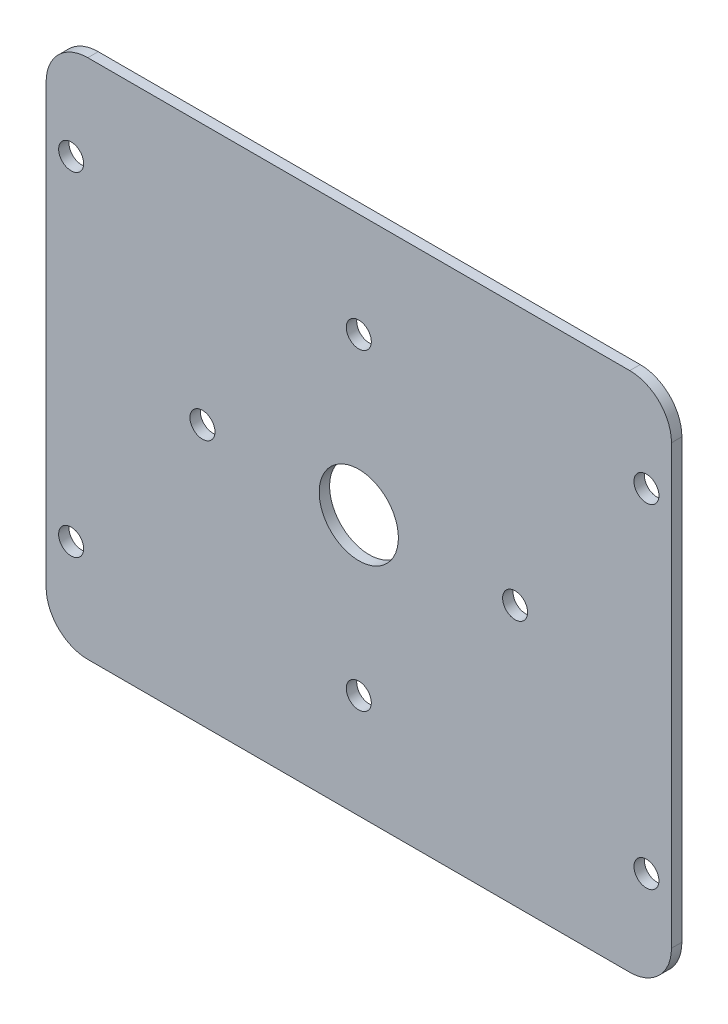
ISO-10303-21;
HEADER;
FILE_DESCRIPTION(('STEP AP214'),'2;1');
FILE_NAME('part.step','',(''),(''),'','','');
FILE_SCHEMA(('AUTOMOTIVE_DESIGN { 1 0 10303 214 1 1 1 1 }'));
ENDSEC;
DATA;
#1=APPLICATION_CONTEXT('core data for automotive mechanical design processes');
#2=APPLICATION_PROTOCOL_DEFINITION('international standard','automotive_design',2000,#1);
#3=PRODUCT_CONTEXT('',#1,'mechanical');
#4=PRODUCT('Part','Part','',(#3));
#5=PRODUCT_RELATED_PRODUCT_CATEGORY('part','',(#4));
#6=PRODUCT_DEFINITION_FORMATION('','',#4);
#7=PRODUCT_DEFINITION_CONTEXT('part definition',#1,'design');
#8=PRODUCT_DEFINITION('design','',#6,#7);
#9=PRODUCT_DEFINITION_SHAPE('','',#8);
#10=(LENGTH_UNIT() NAMED_UNIT(*) SI_UNIT(.MILLI.,.METRE.));
#11=(NAMED_UNIT(*) PLANE_ANGLE_UNIT() SI_UNIT($,.RADIAN.));
#12=(NAMED_UNIT(*) SI_UNIT($,.STERADIAN.) SOLID_ANGLE_UNIT());
#13=UNCERTAINTY_MEASURE_WITH_UNIT(LENGTH_MEASURE(1.E-05),#10,'distance_accuracy_value','');
#14=(GEOMETRIC_REPRESENTATION_CONTEXT(3) GLOBAL_UNCERTAINTY_ASSIGNED_CONTEXT((#13)) GLOBAL_UNIT_ASSIGNED_CONTEXT((#10,
#11,#12)) REPRESENTATION_CONTEXT('',''));
#15=CARTESIAN_POINT('',(0.,0.,0.));
#16=DIRECTION('',(0.,0.,1.));
#17=DIRECTION('',(1.,0.,0.));
#18=AXIS2_PLACEMENT_3D('',#15,#16,#17);
#19=CARTESIAN_POINT('',(0.,0.,5.));
#20=DIRECTION('',(1.,0.,0.));
#21=DIRECTION('',(0.,0.,-1.));
#22=AXIS2_PLACEMENT_3D('',#19,#20,#21);
#23=PLANE('',#22);
#24=DIRECTION('',(0.,-1.,0.));
#25=VECTOR('',#24,1.);
#26=CARTESIAN_POINT('',(0.,0.,0.));
#27=LINE('',#26,#25);
#28=CARTESIAN_POINT('',(0.,230.,0.));
#29=VERTEX_POINT('',#28);
#30=CARTESIAN_POINT('',(0.,20.,0.));
#31=VERTEX_POINT('',#30);
#32=EDGE_CURVE('E127',#29,#31,#27,.T.);
#33=ORIENTED_EDGE('',*,*,#32,.T.);
#34=DIRECTION('',(0.,0.,-1.));
#35=VECTOR('',#34,1.);
#36=CARTESIAN_POINT('',(0.,20.,5.));
#37=LINE('',#36,#35);
#38=CARTESIAN_POINT('',(0.,20.,5.));
#39=VERTEX_POINT('',#38);
#40=EDGE_CURVE('E105',#31,#39,#37,.F.);
#41=ORIENTED_EDGE('',*,*,#40,.T.);
#42=DIRECTION('',(0.,-1.,0.));
#43=VECTOR('',#42,1.);
#44=CARTESIAN_POINT('',(0.,0.,5.));
#45=LINE('',#44,#43);
#46=CARTESIAN_POINT('',(0.,230.,5.));
#47=VERTEX_POINT('',#46);
#48=EDGE_CURVE('E137',#47,#39,#45,.T.);
#49=ORIENTED_EDGE('',*,*,#48,.F.);
#50=DIRECTION('',(0.,0.,-1.));
#51=VECTOR('',#50,1.);
#52=CARTESIAN_POINT('',(0.,230.,5.));
#53=LINE('',#52,#51);
#54=EDGE_CURVE('E110',#47,#29,#53,.T.);
#55=ORIENTED_EDGE('',*,*,#54,.T.);
#56=EDGE_LOOP('',(#33,#41,#49,#55));
#57=FACE_BOUND('',#56,.T.);
#58=ADVANCED_FACE('F35',(#57),#23,.F.);
#59=CARTESIAN_POINT('',(0.,0.,5.));
#60=DIRECTION('',(0.,1.,0.));
#61=DIRECTION('',(0.,0.,1.));
#62=AXIS2_PLACEMENT_3D('',#59,#60,#61);
#63=PLANE('',#62);
#64=DIRECTION('',(1.,0.,0.));
#65=VECTOR('',#64,1.);
#66=CARTESIAN_POINT('',(0.,0.,5.));
#67=LINE('',#66,#65);
#68=CARTESIAN_POINT('',(20.,0.,5.));
#69=VERTEX_POINT('',#68);
#70=CARTESIAN_POINT('',(280.,0.,5.));
#71=VERTEX_POINT('',#70);
#72=EDGE_CURVE('E120',#69,#71,#67,.T.);
#73=ORIENTED_EDGE('',*,*,#72,.F.);
#74=DIRECTION('',(0.,0.,-1.));
#75=VECTOR('',#74,1.);
#76=CARTESIAN_POINT('',(20.,0.,5.));
#77=LINE('',#76,#75);
#78=CARTESIAN_POINT('',(20.,0.,0.));
#79=VERTEX_POINT('',#78);
#80=EDGE_CURVE('E104',#69,#79,#77,.T.);
#81=ORIENTED_EDGE('',*,*,#80,.T.);
#82=DIRECTION('',(1.,0.,0.));
#83=VECTOR('',#82,1.);
#84=CARTESIAN_POINT('',(0.,0.,0.));
#85=LINE('',#84,#83);
#86=CARTESIAN_POINT('',(280.,0.,0.));
#87=VERTEX_POINT('',#86);
#88=EDGE_CURVE('E117',#79,#87,#85,.T.);
#89=ORIENTED_EDGE('',*,*,#88,.T.);
#90=DIRECTION('',(0.,0.,-1.));
#91=VECTOR('',#90,1.);
#92=CARTESIAN_POINT('',(280.,0.,5.));
#93=LINE('',#92,#91);
#94=EDGE_CURVE('E122',#87,#71,#93,.F.);
#95=ORIENTED_EDGE('',*,*,#94,.T.);
#96=EDGE_LOOP('',(#73,#81,#89,#95));
#97=FACE_BOUND('',#96,.T.);
#98=ADVANCED_FACE('F116',(#97),#63,.F.);
#99=CARTESIAN_POINT('',(300.,0.,5.));
#100=DIRECTION('',(-1.,0.,0.));
#101=DIRECTION('',(0.,0.,1.));
#102=AXIS2_PLACEMENT_3D('',#99,#100,#101);
#103=PLANE('',#102);
#104=DIRECTION('',(0.,1.,0.));
#105=VECTOR('',#104,1.);
#106=CARTESIAN_POINT('',(300.,0.,5.));
#107=LINE('',#106,#105);
#108=CARTESIAN_POINT('',(300.,20.,5.));
#109=VERTEX_POINT('',#108);
#110=CARTESIAN_POINT('',(300.,230.,5.));
#111=VERTEX_POINT('',#110);
#112=EDGE_CURVE('E141',#109,#111,#107,.T.);
#113=ORIENTED_EDGE('',*,*,#112,.F.);
#114=DIRECTION('',(0.,0.,-1.));
#115=VECTOR('',#114,1.);
#116=CARTESIAN_POINT('',(300.,20.,5.));
#117=LINE('',#116,#115);
#118=CARTESIAN_POINT('',(300.,20.,0.));
#119=VERTEX_POINT('',#118);
#120=EDGE_CURVE('E162',#109,#119,#117,.T.);
#121=ORIENTED_EDGE('',*,*,#120,.T.);
#122=DIRECTION('',(0.,1.,0.));
#123=VECTOR('',#122,1.);
#124=CARTESIAN_POINT('',(300.,0.,0.));
#125=LINE('',#124,#123);
#126=CARTESIAN_POINT('',(300.,230.,0.));
#127=VERTEX_POINT('',#126);
#128=EDGE_CURVE('E126',#119,#127,#125,.T.);
#129=ORIENTED_EDGE('',*,*,#128,.T.);
#130=DIRECTION('',(0.,0.,-1.));
#131=VECTOR('',#130,1.);
#132=CARTESIAN_POINT('',(300.,230.,5.));
#133=LINE('',#132,#131);
#134=EDGE_CURVE('E160',#127,#111,#133,.F.);
#135=ORIENTED_EDGE('',*,*,#134,.T.);
#136=EDGE_LOOP('',(#113,#121,#129,#135));
#137=FACE_BOUND('',#136,.T.);
#138=ADVANCED_FACE('F167',(#137),#103,.F.);
#139=CARTESIAN_POINT('',(0.,250.,5.));
#140=DIRECTION('',(0.,-1.,0.));
#141=DIRECTION('',(0.,0.,-1.));
#142=AXIS2_PLACEMENT_3D('',#139,#140,#141);
#143=PLANE('',#142);
#144=DIRECTION('',(-1.,0.,0.));
#145=VECTOR('',#144,1.);
#146=CARTESIAN_POINT('',(0.,250.,5.));
#147=LINE('',#146,#145);
#148=CARTESIAN_POINT('',(280.,250.,5.));
#149=VERTEX_POINT('',#148);
#150=CARTESIAN_POINT('',(20.,250.,5.));
#151=VERTEX_POINT('',#150);
#152=EDGE_CURVE('E143',#149,#151,#147,.T.);
#153=ORIENTED_EDGE('',*,*,#152,.F.);
#154=DIRECTION('',(0.,0.,-1.));
#155=VECTOR('',#154,1.);
#156=CARTESIAN_POINT('',(280.,250.,5.));
#157=LINE('',#156,#155);
#158=CARTESIAN_POINT('',(280.,250.,0.));
#159=VERTEX_POINT('',#158);
#160=EDGE_CURVE('E11',#149,#159,#157,.T.);
#161=ORIENTED_EDGE('',*,*,#160,.T.);
#162=DIRECTION('',(-1.,0.,0.));
#163=VECTOR('',#162,1.);
#164=CARTESIAN_POINT('',(0.,250.,0.));
#165=LINE('',#164,#163);
#166=CARTESIAN_POINT('',(20.,250.,0.));
#167=VERTEX_POINT('',#166);
#168=EDGE_CURVE('E130',#159,#167,#165,.T.);
#169=ORIENTED_EDGE('',*,*,#168,.T.);
#170=DIRECTION('',(0.,0.,-1.));
#171=VECTOR('',#170,1.);
#172=CARTESIAN_POINT('',(20.,250.,5.));
#173=LINE('',#172,#171);
#174=EDGE_CURVE('E42',#167,#151,#173,.F.);
#175=ORIENTED_EDGE('',*,*,#174,.T.);
#176=EDGE_LOOP('',(#153,#161,#169,#175));
#177=FACE_BOUND('',#176,.T.);
#178=ADVANCED_FACE('F175',(#177),#143,.F.);
#179=CARTESIAN_POINT('',(0.,250.,5.));
#180=DIRECTION('',(0.,0.,-1.));
#181=DIRECTION('',(-1.,0.,0.));
#182=AXIS2_PLACEMENT_3D('',#179,#180,#181);
#183=PLANE('',#182);
#184=CARTESIAN_POINT('',(149.999999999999,200.,5.));
#185=DIRECTION('',(0.,0.,-1.));
#186=DIRECTION('',(-1.,0.,0.));
#187=AXIS2_PLACEMENT_3D('',#184,#185,#186);
#188=CIRCLE('',#187,6.00000000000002);
#189=CARTESIAN_POINT('',(143.999999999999,200.,5.));
#190=VERTEX_POINT('',#189);
#191=EDGE_CURVE('E267',#190,#190,#188,.T.);
#192=ORIENTED_EDGE('',*,*,#191,.T.);
#193=EDGE_LOOP('',(#192));
#194=FACE_BOUND('',#193,.T.);
#195=CARTESIAN_POINT('',(75.,124.999999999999,5.));
#196=DIRECTION('',(0.,0.,-1.));
#197=DIRECTION('',(-1.,0.,0.));
#198=AXIS2_PLACEMENT_3D('',#195,#196,#197);
#199=CIRCLE('',#198,6.);
#200=CARTESIAN_POINT('',(69.,124.999999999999,5.));
#201=VERTEX_POINT('',#200);
#202=EDGE_CURVE('E261',#201,#201,#199,.T.);
#203=ORIENTED_EDGE('',*,*,#202,.T.);
#204=EDGE_LOOP('',(#203));
#205=FACE_BOUND('',#204,.T.);
#206=CARTESIAN_POINT('',(150.,50.,5.));
#207=DIRECTION('',(0.,0.,-1.));
#208=DIRECTION('',(-1.,0.,0.));
#209=AXIS2_PLACEMENT_3D('',#206,#207,#208);
#210=CIRCLE('',#209,6.00000000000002);
#211=CARTESIAN_POINT('',(144.,50.,5.));
#212=VERTEX_POINT('',#211);
#213=EDGE_CURVE('E255',#212,#212,#210,.T.);
#214=ORIENTED_EDGE('',*,*,#213,.T.);
#215=EDGE_LOOP('',(#214));
#216=FACE_BOUND('',#215,.T.);
#217=CARTESIAN_POINT('',(225.,125.,5.));
#218=DIRECTION('',(0.,0.,-1.));
#219=DIRECTION('',(-1.,0.,0.));
#220=AXIS2_PLACEMENT_3D('',#217,#218,#219);
#221=CIRCLE('',#220,6.00000000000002);
#222=CARTESIAN_POINT('',(219.,125.,5.));
#223=VERTEX_POINT('',#222);
#224=EDGE_CURVE('E249',#223,#223,#221,.T.);
#225=ORIENTED_EDGE('',*,*,#224,.T.);
#226=EDGE_LOOP('',(#225));
#227=FACE_BOUND('',#226,.T.);
#228=CARTESIAN_POINT('',(288.,205.,5.));
#229=DIRECTION('',(0.,0.,1.));
#230=DIRECTION('',(-1.,0.,0.));
#231=AXIS2_PLACEMENT_3D('',#228,#229,#230);
#232=CIRCLE('',#231,5.99999999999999);
#233=CARTESIAN_POINT('',(282.,205.,5.));
#234=VERTEX_POINT('',#233);
#235=EDGE_CURVE('E245',#234,#234,#232,.T.);
#236=ORIENTED_EDGE('',*,*,#235,.F.);
#237=EDGE_LOOP('',(#236));
#238=FACE_BOUND('',#237,.T.);
#239=CARTESIAN_POINT('',(288.,45.,5.));
#240=DIRECTION('',(0.,0.,1.));
#241=DIRECTION('',(1.,0.,0.));
#242=AXIS2_PLACEMENT_3D('',#239,#240,#241);
#243=CIRCLE('',#242,5.99999999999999);
#244=CARTESIAN_POINT('',(294.,45.,5.));
#245=VERTEX_POINT('',#244);
#246=EDGE_CURVE('E238',#245,#245,#243,.T.);
#247=ORIENTED_EDGE('',*,*,#246,.F.);
#248=EDGE_LOOP('',(#247));
#249=FACE_BOUND('',#248,.T.);
#250=CARTESIAN_POINT('',(12.,45.,5.));
#251=DIRECTION('',(0.,0.,1.));
#252=DIRECTION('',(-1.,0.,0.));
#253=AXIS2_PLACEMENT_3D('',#250,#251,#252);
#254=CIRCLE('',#253,6.00000000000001);
#255=CARTESIAN_POINT('',(5.99999999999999,45.,5.));
#256=VERTEX_POINT('',#255);
#257=EDGE_CURVE('E232',#256,#256,#254,.T.);
#258=ORIENTED_EDGE('',*,*,#257,.F.);
#259=EDGE_LOOP('',(#258));
#260=FACE_BOUND('',#259,.T.);
#261=CARTESIAN_POINT('',(12.,205.,5.));
#262=DIRECTION('',(0.,0.,1.));
#263=DIRECTION('',(1.,0.,0.));
#264=AXIS2_PLACEMENT_3D('',#261,#262,#263);
#265=CIRCLE('',#264,6.00000000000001);
#266=CARTESIAN_POINT('',(18.,205.,5.));
#267=VERTEX_POINT('',#266);
#268=EDGE_CURVE('E224',#267,#267,#265,.T.);
#269=ORIENTED_EDGE('',*,*,#268,.F.);
#270=EDGE_LOOP('',(#269));
#271=FACE_BOUND('',#270,.T.);
#272=CARTESIAN_POINT('',(150.,125.,5.));
#273=DIRECTION('',(0.,0.,1.));
#274=DIRECTION('',(1.,0.,0.));
#275=AXIS2_PLACEMENT_3D('',#272,#273,#274);
#276=CIRCLE('',#275,19.);
#277=CARTESIAN_POINT('',(169.,125.,5.));
#278=VERTEX_POINT('',#277);
#279=EDGE_CURVE('E219',#278,#278,#276,.T.);
#280=ORIENTED_EDGE('',*,*,#279,.F.);
#281=EDGE_LOOP('',(#280));
#282=FACE_BOUND('',#281,.T.);
#283=ORIENTED_EDGE('',*,*,#48,.T.);
#284=CARTESIAN_POINT('',(20.,20.,5.));
#285=DIRECTION('',(0.,0.,-1.));
#286=DIRECTION('',(-1.,0.,0.));
#287=AXIS2_PLACEMENT_3D('',#284,#285,#286);
#288=CIRCLE('',#287,20.);
#289=EDGE_CURVE('E158',#39,#69,#288,.F.);
#290=ORIENTED_EDGE('',*,*,#289,.T.);
#291=ORIENTED_EDGE('',*,*,#72,.T.);
#292=CARTESIAN_POINT('',(280.,20.,5.));
#293=DIRECTION('',(0.,0.,-1.));
#294=DIRECTION('',(-1.,0.,0.));
#295=AXIS2_PLACEMENT_3D('',#292,#293,#294);
#296=CIRCLE('',#295,20.);
#297=EDGE_CURVE('E156',#71,#109,#296,.F.);
#298=ORIENTED_EDGE('',*,*,#297,.T.);
#299=ORIENTED_EDGE('',*,*,#112,.T.);
#300=CARTESIAN_POINT('',(280.,230.,5.));
#301=DIRECTION('',(0.,0.,-1.));
#302=DIRECTION('',(-1.,0.,0.));
#303=AXIS2_PLACEMENT_3D('',#300,#301,#302);
#304=CIRCLE('',#303,20.);
#305=EDGE_CURVE('E55',#111,#149,#304,.F.);
#306=ORIENTED_EDGE('',*,*,#305,.T.);
#307=ORIENTED_EDGE('',*,*,#152,.T.);
#308=CARTESIAN_POINT('',(20.,230.,5.));
#309=DIRECTION('',(0.,0.,-1.));
#310=DIRECTION('',(-1.,0.,0.));
#311=AXIS2_PLACEMENT_3D('',#308,#309,#310);
#312=CIRCLE('',#311,20.);
#313=EDGE_CURVE('E153',#151,#47,#312,.F.);
#314=ORIENTED_EDGE('',*,*,#313,.T.);
#315=EDGE_LOOP('',(#283,#290,#291,#298,#299,#306,#307,#314));
#316=FACE_BOUND('',#315,.T.);
#317=ADVANCED_FACE('F177',(#194,#205,#216,#227,#238,#249,#260,#271,#282,#316),#183,.F.);
#318=CARTESIAN_POINT('',(0.,250.,0.));
#319=DIRECTION('',(0.,0.,-1.));
#320=DIRECTION('',(-1.,0.,0.));
#321=AXIS2_PLACEMENT_3D('',#318,#319,#320);
#322=PLANE('',#321);
#323=CARTESIAN_POINT('',(149.999999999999,200.,0.));
#324=DIRECTION('',(0.,0.,-1.));
#325=DIRECTION('',(-1.,0.,0.));
#326=AXIS2_PLACEMENT_3D('',#323,#324,#325);
#327=CIRCLE('',#326,6.00000000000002);
#328=CARTESIAN_POINT('',(143.999999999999,200.,0.));
#329=VERTEX_POINT('',#328);
#330=EDGE_CURVE('E270',#329,#329,#327,.T.);
#331=ORIENTED_EDGE('',*,*,#330,.F.);
#332=EDGE_LOOP('',(#331));
#333=FACE_BOUND('',#332,.T.);
#334=CARTESIAN_POINT('',(75.,124.999999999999,0.));
#335=DIRECTION('',(0.,0.,-1.));
#336=DIRECTION('',(-1.,0.,0.));
#337=AXIS2_PLACEMENT_3D('',#334,#335,#336);
#338=CIRCLE('',#337,6.);
#339=CARTESIAN_POINT('',(69.,124.999999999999,0.));
#340=VERTEX_POINT('',#339);
#341=EDGE_CURVE('E264',#340,#340,#338,.T.);
#342=ORIENTED_EDGE('',*,*,#341,.F.);
#343=EDGE_LOOP('',(#342));
#344=FACE_BOUND('',#343,.T.);
#345=CARTESIAN_POINT('',(150.,50.,0.));
#346=DIRECTION('',(0.,0.,-1.));
#347=DIRECTION('',(-1.,0.,0.));
#348=AXIS2_PLACEMENT_3D('',#345,#346,#347);
#349=CIRCLE('',#348,6.00000000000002);
#350=CARTESIAN_POINT('',(144.,50.,0.));
#351=VERTEX_POINT('',#350);
#352=EDGE_CURVE('E258',#351,#351,#349,.T.);
#353=ORIENTED_EDGE('',*,*,#352,.F.);
#354=EDGE_LOOP('',(#353));
#355=FACE_BOUND('',#354,.T.);
#356=CARTESIAN_POINT('',(225.,125.,0.));
#357=DIRECTION('',(0.,0.,-1.));
#358=DIRECTION('',(-1.,0.,0.));
#359=AXIS2_PLACEMENT_3D('',#356,#357,#358);
#360=CIRCLE('',#359,6.00000000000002);
#361=CARTESIAN_POINT('',(219.,125.,0.));
#362=VERTEX_POINT('',#361);
#363=EDGE_CURVE('E252',#362,#362,#360,.T.);
#364=ORIENTED_EDGE('',*,*,#363,.F.);
#365=EDGE_LOOP('',(#364));
#366=FACE_BOUND('',#365,.T.);
#367=CARTESIAN_POINT('',(288.,205.,0.));
#368=DIRECTION('',(0.,0.,1.));
#369=DIRECTION('',(-1.,0.,0.));
#370=AXIS2_PLACEMENT_3D('',#367,#368,#369);
#371=CIRCLE('',#370,5.99999999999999);
#372=CARTESIAN_POINT('',(282.,205.,0.));
#373=VERTEX_POINT('',#372);
#374=EDGE_CURVE('E242',#373,#373,#371,.T.);
#375=ORIENTED_EDGE('',*,*,#374,.T.);
#376=EDGE_LOOP('',(#375));
#377=FACE_BOUND('',#376,.T.);
#378=CARTESIAN_POINT('',(288.,45.,0.));
#379=DIRECTION('',(0.,0.,1.));
#380=DIRECTION('',(1.,0.,0.));
#381=AXIS2_PLACEMENT_3D('',#378,#379,#380);
#382=CIRCLE('',#381,5.99999999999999);
#383=CARTESIAN_POINT('',(294.,45.,0.));
#384=VERTEX_POINT('',#383);
#385=EDGE_CURVE('E235',#384,#384,#382,.T.);
#386=ORIENTED_EDGE('',*,*,#385,.T.);
#387=EDGE_LOOP('',(#386));
#388=FACE_BOUND('',#387,.T.);
#389=CARTESIAN_POINT('',(12.,45.,0.));
#390=DIRECTION('',(0.,0.,1.));
#391=DIRECTION('',(-1.,0.,0.));
#392=AXIS2_PLACEMENT_3D('',#389,#390,#391);
#393=CIRCLE('',#392,6.00000000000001);
#394=CARTESIAN_POINT('',(5.99999999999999,45.,0.));
#395=VERTEX_POINT('',#394);
#396=EDGE_CURVE('E229',#395,#395,#393,.T.);
#397=ORIENTED_EDGE('',*,*,#396,.T.);
#398=EDGE_LOOP('',(#397));
#399=FACE_BOUND('',#398,.T.);
#400=CARTESIAN_POINT('',(12.,205.,0.));
#401=DIRECTION('',(0.,0.,1.));
#402=DIRECTION('',(1.,0.,0.));
#403=AXIS2_PLACEMENT_3D('',#400,#401,#402);
#404=CIRCLE('',#403,6.00000000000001);
#405=CARTESIAN_POINT('',(18.,205.,0.));
#406=VERTEX_POINT('',#405);
#407=EDGE_CURVE('E221',#406,#406,#404,.T.);
#408=ORIENTED_EDGE('',*,*,#407,.T.);
#409=EDGE_LOOP('',(#408));
#410=FACE_BOUND('',#409,.T.);
#411=CARTESIAN_POINT('',(150.,125.,0.));
#412=DIRECTION('',(0.,0.,1.));
#413=DIRECTION('',(1.,0.,0.));
#414=AXIS2_PLACEMENT_3D('',#411,#412,#413);
#415=CIRCLE('',#414,19.);
#416=CARTESIAN_POINT('',(169.,125.,0.));
#417=VERTEX_POINT('',#416);
#418=EDGE_CURVE('E132',#417,#417,#415,.T.);
#419=ORIENTED_EDGE('',*,*,#418,.T.);
#420=EDGE_LOOP('',(#419));
#421=FACE_BOUND('',#420,.T.);
#422=ORIENTED_EDGE('',*,*,#88,.F.);
#423=CARTESIAN_POINT('',(20.,20.,0.));
#424=DIRECTION('',(0.,0.,-1.));
#425=DIRECTION('',(-1.,0.,0.));
#426=AXIS2_PLACEMENT_3D('',#423,#424,#425);
#427=CIRCLE('',#426,20.);
#428=EDGE_CURVE('E100',#79,#31,#427,.T.);
#429=ORIENTED_EDGE('',*,*,#428,.T.);
#430=ORIENTED_EDGE('',*,*,#32,.F.);
#431=CARTESIAN_POINT('',(20.,230.,0.));
#432=DIRECTION('',(0.,0.,-1.));
#433=DIRECTION('',(-1.,0.,0.));
#434=AXIS2_PLACEMENT_3D('',#431,#432,#433);
#435=CIRCLE('',#434,20.);
#436=EDGE_CURVE('E121',#29,#167,#435,.T.);
#437=ORIENTED_EDGE('',*,*,#436,.T.);
#438=ORIENTED_EDGE('',*,*,#168,.F.);
#439=CARTESIAN_POINT('',(280.,230.,0.));
#440=DIRECTION('',(0.,0.,-1.));
#441=DIRECTION('',(-1.,0.,0.));
#442=AXIS2_PLACEMENT_3D('',#439,#440,#441);
#443=CIRCLE('',#442,20.);
#444=EDGE_CURVE('E147',#159,#127,#443,.T.);
#445=ORIENTED_EDGE('',*,*,#444,.T.);
#446=ORIENTED_EDGE('',*,*,#128,.F.);
#447=CARTESIAN_POINT('',(280.,20.,0.));
#448=DIRECTION('',(0.,0.,-1.));
#449=DIRECTION('',(-1.,0.,0.));
#450=AXIS2_PLACEMENT_3D('',#447,#448,#449);
#451=CIRCLE('',#450,20.);
#452=EDGE_CURVE('E111',#119,#87,#451,.T.);
#453=ORIENTED_EDGE('',*,*,#452,.T.);
#454=EDGE_LOOP('',(#422,#429,#430,#437,#438,#445,#446,#453));
#455=FACE_BOUND('',#454,.T.);
#456=ADVANCED_FACE('F124',(#333,#344,#355,#366,#377,#388,#399,#410,#421,#455),#322,.T.);
#457=CARTESIAN_POINT('',(150.,125.,0.));
#458=DIRECTION('',(0.,0.,1.));
#459=DIRECTION('',(1.,0.,0.));
#460=AXIS2_PLACEMENT_3D('',#457,#458,#459);
#461=CYLINDRICAL_SURFACE('',#460,19.);
#462=ORIENTED_EDGE('',*,*,#418,.F.);
#463=EDGE_LOOP('',(#462));
#464=FACE_BOUND('',#463,.T.);
#465=ORIENTED_EDGE('',*,*,#279,.T.);
#466=EDGE_LOOP('',(#465));
#467=FACE_BOUND('',#466,.T.);
#468=ADVANCED_FACE('F191',(#464,#467),#461,.F.);
#469=CARTESIAN_POINT('',(20.,20.,5.));
#470=DIRECTION('',(0.,0.,-1.));
#471=DIRECTION('',(-1.,0.,0.));
#472=AXIS2_PLACEMENT_3D('',#469,#470,#471);
#473=CYLINDRICAL_SURFACE('',#472,20.);
#474=ORIENTED_EDGE('',*,*,#289,.F.);
#475=ORIENTED_EDGE('',*,*,#40,.F.);
#476=ORIENTED_EDGE('',*,*,#428,.F.);
#477=ORIENTED_EDGE('',*,*,#80,.F.);
#478=EDGE_LOOP('',(#474,#475,#476,#477));
#479=FACE_BOUND('',#478,.T.);
#480=ADVANCED_FACE('F103',(#479),#473,.T.);
#481=CARTESIAN_POINT('',(280.,20.,5.));
#482=DIRECTION('',(0.,0.,-1.));
#483=DIRECTION('',(-1.,0.,0.));
#484=AXIS2_PLACEMENT_3D('',#481,#482,#483);
#485=CYLINDRICAL_SURFACE('',#484,20.);
#486=ORIENTED_EDGE('',*,*,#297,.F.);
#487=ORIENTED_EDGE('',*,*,#94,.F.);
#488=ORIENTED_EDGE('',*,*,#452,.F.);
#489=ORIENTED_EDGE('',*,*,#120,.F.);
#490=EDGE_LOOP('',(#486,#487,#488,#489));
#491=FACE_BOUND('',#490,.T.);
#492=ADVANCED_FACE('F183',(#491),#485,.T.);
#493=CARTESIAN_POINT('',(280.,230.,5.));
#494=DIRECTION('',(0.,0.,-1.));
#495=DIRECTION('',(-1.,0.,0.));
#496=AXIS2_PLACEMENT_3D('',#493,#494,#495);
#497=CYLINDRICAL_SURFACE('',#496,20.);
#498=ORIENTED_EDGE('',*,*,#305,.F.);
#499=ORIENTED_EDGE('',*,*,#134,.F.);
#500=ORIENTED_EDGE('',*,*,#444,.F.);
#501=ORIENTED_EDGE('',*,*,#160,.F.);
#502=EDGE_LOOP('',(#498,#499,#500,#501));
#503=FACE_BOUND('',#502,.T.);
#504=ADVANCED_FACE('F174',(#503),#497,.T.);
#505=CARTESIAN_POINT('',(20.,230.,5.));
#506=DIRECTION('',(0.,0.,-1.));
#507=DIRECTION('',(-1.,0.,0.));
#508=AXIS2_PLACEMENT_3D('',#505,#506,#507);
#509=CYLINDRICAL_SURFACE('',#508,20.);
#510=ORIENTED_EDGE('',*,*,#313,.F.);
#511=ORIENTED_EDGE('',*,*,#174,.F.);
#512=ORIENTED_EDGE('',*,*,#436,.F.);
#513=ORIENTED_EDGE('',*,*,#54,.F.);
#514=EDGE_LOOP('',(#510,#511,#512,#513));
#515=FACE_BOUND('',#514,.T.);
#516=ADVANCED_FACE('F181',(#515),#509,.T.);
#517=CARTESIAN_POINT('',(12.,205.,0.));
#518=DIRECTION('',(0.,0.,1.));
#519=DIRECTION('',(1.,0.,0.));
#520=AXIS2_PLACEMENT_3D('',#517,#518,#519);
#521=CYLINDRICAL_SURFACE('',#520,6.00000000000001);
#522=ORIENTED_EDGE('',*,*,#407,.F.);
#523=EDGE_LOOP('',(#522));
#524=FACE_BOUND('',#523,.T.);
#525=ORIENTED_EDGE('',*,*,#268,.T.);
#526=EDGE_LOOP('',(#525));
#527=FACE_BOUND('',#526,.T.);
#528=ADVANCED_FACE('F291',(#524,#527),#521,.F.);
#529=CARTESIAN_POINT('',(12.,45.,0.));
#530=DIRECTION('',(0.,0.,1.));
#531=DIRECTION('',(1.,0.,0.));
#532=AXIS2_PLACEMENT_3D('',#529,#530,#531);
#533=CYLINDRICAL_SURFACE('',#532,6.00000000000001);
#534=ORIENTED_EDGE('',*,*,#396,.F.);
#535=EDGE_LOOP('',(#534));
#536=FACE_BOUND('',#535,.T.);
#537=ORIENTED_EDGE('',*,*,#257,.T.);
#538=EDGE_LOOP('',(#537));
#539=FACE_BOUND('',#538,.T.);
#540=ADVANCED_FACE('F294',(#536,#539),#533,.F.);
#541=CARTESIAN_POINT('',(288.,45.,0.));
#542=DIRECTION('',(0.,0.,1.));
#543=DIRECTION('',(1.,0.,0.));
#544=AXIS2_PLACEMENT_3D('',#541,#542,#543);
#545=CYLINDRICAL_SURFACE('',#544,5.99999999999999);
#546=ORIENTED_EDGE('',*,*,#385,.F.);
#547=EDGE_LOOP('',(#546));
#548=FACE_BOUND('',#547,.T.);
#549=ORIENTED_EDGE('',*,*,#246,.T.);
#550=EDGE_LOOP('',(#549));
#551=FACE_BOUND('',#550,.T.);
#552=ADVANCED_FACE('F302',(#548,#551),#545,.F.);
#553=CARTESIAN_POINT('',(288.,205.,0.));
#554=DIRECTION('',(0.,0.,1.));
#555=DIRECTION('',(1.,0.,0.));
#556=AXIS2_PLACEMENT_3D('',#553,#554,#555);
#557=CYLINDRICAL_SURFACE('',#556,5.99999999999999);
#558=ORIENTED_EDGE('',*,*,#374,.F.);
#559=EDGE_LOOP('',(#558));
#560=FACE_BOUND('',#559,.T.);
#561=ORIENTED_EDGE('',*,*,#235,.T.);
#562=EDGE_LOOP('',(#561));
#563=FACE_BOUND('',#562,.T.);
#564=ADVANCED_FACE('F309',(#560,#563),#557,.F.);
#565=CARTESIAN_POINT('',(225.,125.,5.));
#566=DIRECTION('',(0.,0.,-1.));
#567=DIRECTION('',(-1.,0.,0.));
#568=AXIS2_PLACEMENT_3D('',#565,#566,#567);
#569=CYLINDRICAL_SURFACE('',#568,6.00000000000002);
#570=ORIENTED_EDGE('',*,*,#224,.F.);
#571=EDGE_LOOP('',(#570));
#572=FACE_BOUND('',#571,.T.);
#573=ORIENTED_EDGE('',*,*,#363,.T.);
#574=EDGE_LOOP('',(#573));
#575=FACE_BOUND('',#574,.T.);
#576=ADVANCED_FACE('F313',(#572,#575),#569,.F.);
#577=CARTESIAN_POINT('',(150.,50.,5.));
#578=DIRECTION('',(0.,0.,-1.));
#579=DIRECTION('',(-1.,0.,0.));
#580=AXIS2_PLACEMENT_3D('',#577,#578,#579);
#581=CYLINDRICAL_SURFACE('',#580,6.00000000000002);
#582=ORIENTED_EDGE('',*,*,#213,.F.);
#583=EDGE_LOOP('',(#582));
#584=FACE_BOUND('',#583,.T.);
#585=ORIENTED_EDGE('',*,*,#352,.T.);
#586=EDGE_LOOP('',(#585));
#587=FACE_BOUND('',#586,.T.);
#588=ADVANCED_FACE('F317',(#584,#587),#581,.F.);
#589=CARTESIAN_POINT('',(75.,124.999999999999,5.));
#590=DIRECTION('',(0.,0.,-1.));
#591=DIRECTION('',(-1.,0.,0.));
#592=AXIS2_PLACEMENT_3D('',#589,#590,#591);
#593=CYLINDRICAL_SURFACE('',#592,6.);
#594=ORIENTED_EDGE('',*,*,#202,.F.);
#595=EDGE_LOOP('',(#594));
#596=FACE_BOUND('',#595,.T.);
#597=ORIENTED_EDGE('',*,*,#341,.T.);
#598=EDGE_LOOP('',(#597));
#599=FACE_BOUND('',#598,.T.);
#600=ADVANCED_FACE('F321',(#596,#599),#593,.F.);
#601=CARTESIAN_POINT('',(149.999999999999,200.,5.));
#602=DIRECTION('',(0.,0.,-1.));
#603=DIRECTION('',(-1.,0.,0.));
#604=AXIS2_PLACEMENT_3D('',#601,#602,#603);
#605=CYLINDRICAL_SURFACE('',#604,6.00000000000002);
#606=ORIENTED_EDGE('',*,*,#191,.F.);
#607=EDGE_LOOP('',(#606));
#608=FACE_BOUND('',#607,.T.);
#609=ORIENTED_EDGE('',*,*,#330,.T.);
#610=EDGE_LOOP('',(#609));
#611=FACE_BOUND('',#610,.T.);
#612=ADVANCED_FACE('F274',(#608,#611),#605,.F.);
#613=CLOSED_SHELL('',(#58,#98,#138,#178,#317,#456,#468,#480,#492,#504,#516,#528,#540,#552,#564,
#576,#588,#600,#612));
#614=MANIFOLD_SOLID_BREP('B2',#613);
#615=ADVANCED_BREP_SHAPE_REPRESENTATION('',(#18,#614),#14);
#616=SHAPE_DEFINITION_REPRESENTATION(#9,#615);
ENDSEC;
END-ISO-10303-21;
